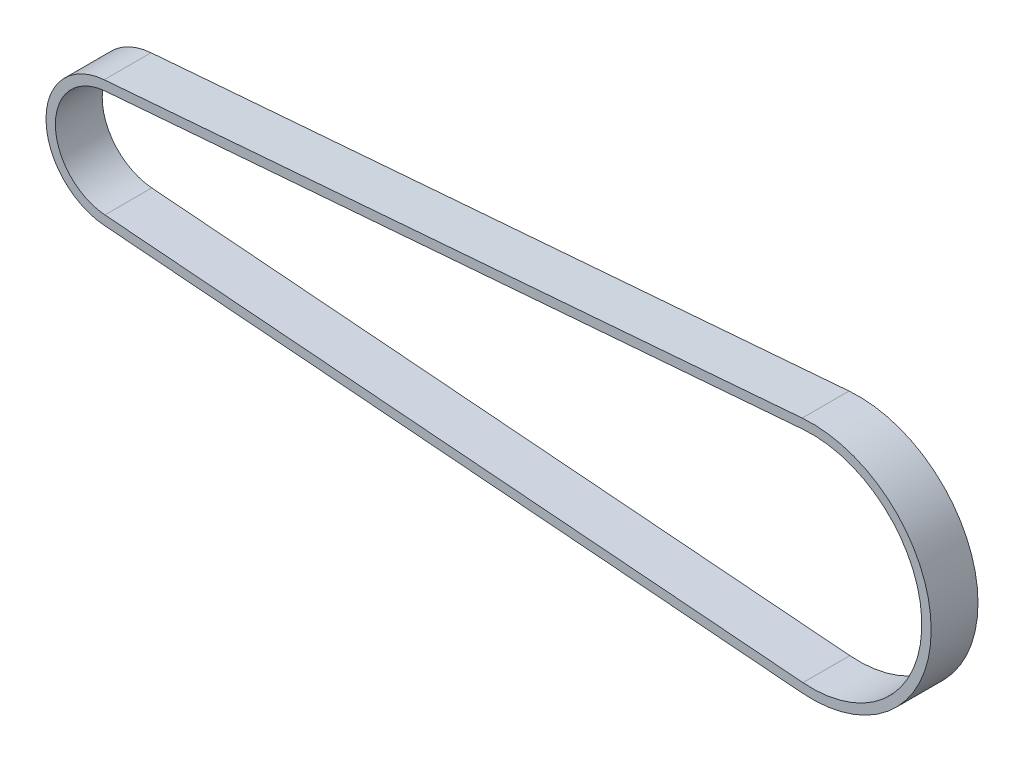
from build123d import *

# Parameters (mm, degrees)
EXTRUDE_1_DEPTH = 10


with BuildPart() as part:
    # Sketch 2 → Extrude 1 (new body)
    with BuildSketch(Plane.XY):
        with BuildLine():
            Line((-151.08, 13.456730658), (-2.04, 25.418269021))
            ThreePointArc((-2.04, 25.418269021), (25.5, 0), (-2.04, -25.418269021))
            Line((-2.04, -25.418269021), (-151.08, -13.456730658))
            ThreePointArc((-151.08, -13.456730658), (-163.5, 0), (-151.08, 13.456730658))
        make_face()
        with BuildLine():
            Line((-150.92, 11.463140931), (-1.88, 23.424679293))
            ThreePointArc((-1.88, 23.424679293), (23.5, 0), (-1.88, -23.424679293))
            Line((-1.88, -23.424679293), (-150.92, -11.463140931))
            ThreePointArc((-150.92, -11.463140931), (-161.5, 0), (-150.92, 11.463140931))
        make_face(mode=Mode.SUBTRACT)
    extrude(amount=EXTRUDE_1_DEPTH)


solid = part.part
